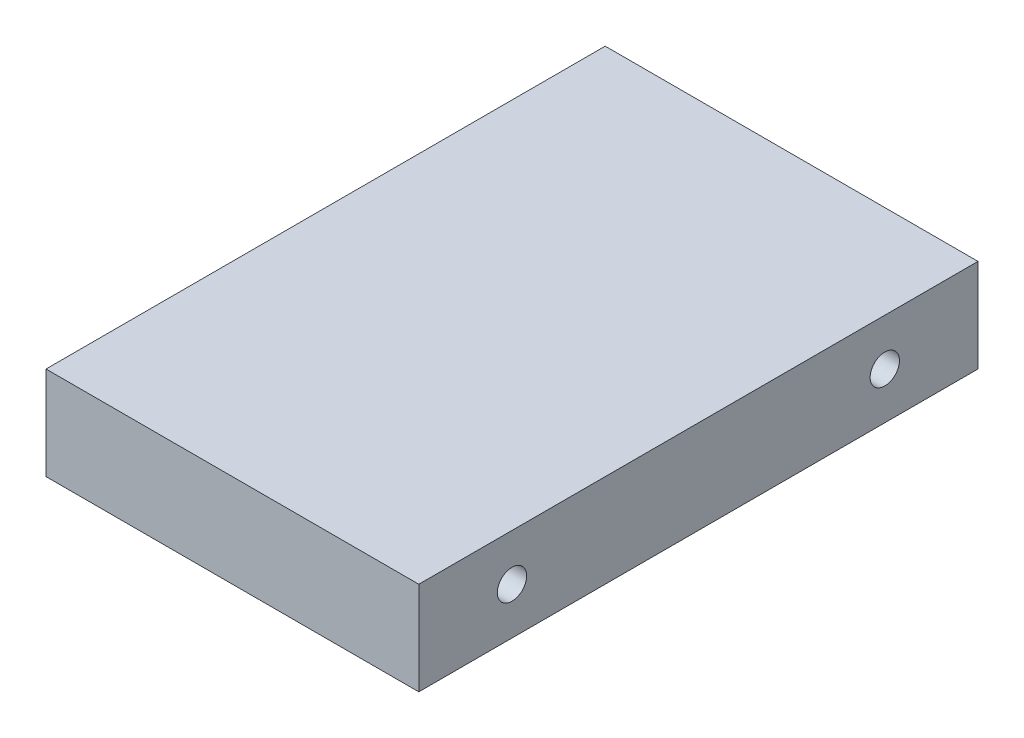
ISO-10303-21;
HEADER;
FILE_DESCRIPTION(('STEP AP214'),'2;1');
FILE_NAME('part.step','',(''),(''),'','','');
FILE_SCHEMA(('AUTOMOTIVE_DESIGN { 1 0 10303 214 1 1 1 1 }'));
ENDSEC;
DATA;
#1=APPLICATION_CONTEXT('core data for automotive mechanical design processes');
#2=APPLICATION_PROTOCOL_DEFINITION('international standard','automotive_design',2000,#1);
#3=PRODUCT_CONTEXT('',#1,'mechanical');
#4=PRODUCT('Part','Part','',(#3));
#5=PRODUCT_RELATED_PRODUCT_CATEGORY('part','',(#4));
#6=PRODUCT_DEFINITION_FORMATION('','',#4);
#7=PRODUCT_DEFINITION_CONTEXT('part definition',#1,'design');
#8=PRODUCT_DEFINITION('design','',#6,#7);
#9=PRODUCT_DEFINITION_SHAPE('','',#8);
#10=(LENGTH_UNIT() NAMED_UNIT(*) SI_UNIT(.MILLI.,.METRE.));
#11=(NAMED_UNIT(*) PLANE_ANGLE_UNIT() SI_UNIT($,.RADIAN.));
#12=(NAMED_UNIT(*) SI_UNIT($,.STERADIAN.) SOLID_ANGLE_UNIT());
#13=UNCERTAINTY_MEASURE_WITH_UNIT(LENGTH_MEASURE(1.E-05),#10,'distance_accuracy_value','');
#14=(GEOMETRIC_REPRESENTATION_CONTEXT(3) GLOBAL_UNCERTAINTY_ASSIGNED_CONTEXT((#13)) GLOBAL_UNIT_ASSIGNED_CONTEXT((#10,
#11,#12)) REPRESENTATION_CONTEXT('',''));
#15=CARTESIAN_POINT('',(0.,0.,0.));
#16=DIRECTION('',(0.,0.,1.));
#17=DIRECTION('',(1.,0.,0.));
#18=AXIS2_PLACEMENT_3D('',#15,#16,#17);
#19=CARTESIAN_POINT('',(-65.4996894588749,12.7,-16.1098780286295));
#20=DIRECTION('',(1.,0.,0.));
#21=DIRECTION('',(0.,0.,-1.));
#22=AXIS2_PLACEMENT_3D('',#19,#20,#21);
#23=PLANE('',#22);
#24=CARTESIAN_POINT('',(-65.4996894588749,6.35,-3.40987802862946));
#25=DIRECTION('',(1.,0.,0.));
#26=DIRECTION('',(0.,0.,-1.));
#27=AXIS2_PLACEMENT_3D('',#24,#25,#26);
#28=CIRCLE('',#27,1.99999999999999);
#29=CARTESIAN_POINT('',(-65.4996894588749,6.35,-5.40987802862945));
#30=VERTEX_POINT('',#29);
#31=EDGE_CURVE('E115',#30,#30,#28,.T.);
#32=ORIENTED_EDGE('',*,*,#31,.T.);
#33=EDGE_LOOP('',(#32));
#34=FACE_BOUND('',#33,.T.);
#35=CARTESIAN_POINT('',(-65.4996894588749,6.35,47.3901219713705));
#36=DIRECTION('',(1.,0.,0.));
#37=DIRECTION('',(0.,0.,-1.));
#38=AXIS2_PLACEMENT_3D('',#35,#36,#37);
#39=CIRCLE('',#38,1.99999999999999);
#40=CARTESIAN_POINT('',(-65.4996894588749,6.35,45.3901219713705));
#41=VERTEX_POINT('',#40);
#42=EDGE_CURVE('E99',#41,#41,#39,.T.);
#43=ORIENTED_EDGE('',*,*,#42,.T.);
#44=EDGE_LOOP('',(#43));
#45=FACE_BOUND('',#44,.T.);
#46=DIRECTION('',(0.,0.,1.));
#47=VECTOR('',#46,1.);
#48=CARTESIAN_POINT('',(-65.4996894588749,0.,-16.1098780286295));
#49=LINE('',#48,#47);
#50=CARTESIAN_POINT('',(-65.4996894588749,0.,-16.1098780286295));
#51=VERTEX_POINT('',#50);
#52=CARTESIAN_POINT('',(-65.4996894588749,0.,60.0901219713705));
#53=VERTEX_POINT('',#52);
#54=EDGE_CURVE('E96',#51,#53,#49,.T.);
#55=ORIENTED_EDGE('',*,*,#54,.T.);
#56=DIRECTION('',(0.,-1.,0.));
#57=VECTOR('',#56,1.);
#58=CARTESIAN_POINT('',(-65.4996894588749,12.7,60.0901219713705));
#59=LINE('',#58,#57);
#60=CARTESIAN_POINT('',(-65.4996894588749,12.7,60.0901219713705));
#61=VERTEX_POINT('',#60);
#62=EDGE_CURVE('E11',#61,#53,#59,.T.);
#63=ORIENTED_EDGE('',*,*,#62,.F.);
#64=DIRECTION('',(0.,0.,1.));
#65=VECTOR('',#64,1.);
#66=CARTESIAN_POINT('',(-65.4996894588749,12.7,-16.1098780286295));
#67=LINE('',#66,#65);
#68=CARTESIAN_POINT('',(-65.4996894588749,12.7,-16.1098780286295));
#69=VERTEX_POINT('',#68);
#70=EDGE_CURVE('E84',#69,#61,#67,.T.);
#71=ORIENTED_EDGE('',*,*,#70,.F.);
#72=DIRECTION('',(0.,-1.,0.));
#73=VECTOR('',#72,1.);
#74=CARTESIAN_POINT('',(-65.4996894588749,12.7,-16.1098780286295));
#75=LINE('',#74,#73);
#76=EDGE_CURVE('E92',#69,#51,#75,.T.);
#77=ORIENTED_EDGE('',*,*,#76,.T.);
#78=EDGE_LOOP('',(#55,#63,#71,#77));
#79=FACE_BOUND('',#78,.T.);
#80=ADVANCED_FACE('F33',(#34,#45,#79),#23,.F.);
#81=CARTESIAN_POINT('',(-65.4996894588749,12.7,60.0901219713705));
#82=DIRECTION('',(0.,0.,-1.));
#83=DIRECTION('',(-1.,0.,0.));
#84=AXIS2_PLACEMENT_3D('',#81,#82,#83);
#85=PLANE('',#84);
#86=DIRECTION('',(1.,0.,0.));
#87=VECTOR('',#86,1.);
#88=CARTESIAN_POINT('',(-65.4996894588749,0.,60.0901219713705));
#89=LINE('',#88,#87);
#90=CARTESIAN_POINT('',(-14.6996894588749,0.,60.0901219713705));
#91=VERTEX_POINT('',#90);
#92=EDGE_CURVE('E88',#53,#91,#89,.T.);
#93=ORIENTED_EDGE('',*,*,#92,.T.);
#94=DIRECTION('',(0.,-1.,0.));
#95=VECTOR('',#94,1.);
#96=CARTESIAN_POINT('',(-14.6996894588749,12.7,60.0901219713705));
#97=LINE('',#96,#95);
#98=CARTESIAN_POINT('',(-14.6996894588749,12.7,60.0901219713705));
#99=VERTEX_POINT('',#98);
#100=EDGE_CURVE('E41',#99,#91,#97,.T.);
#101=ORIENTED_EDGE('',*,*,#100,.F.);
#102=DIRECTION('',(1.,0.,0.));
#103=VECTOR('',#102,1.);
#104=CARTESIAN_POINT('',(-65.4996894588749,12.7,60.0901219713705));
#105=LINE('',#104,#103);
#106=EDGE_CURVE('E79',#61,#99,#105,.T.);
#107=ORIENTED_EDGE('',*,*,#106,.F.);
#108=ORIENTED_EDGE('',*,*,#62,.T.);
#109=EDGE_LOOP('',(#93,#101,#107,#108));
#110=FACE_BOUND('',#109,.T.);
#111=ADVANCED_FACE('F87',(#110),#85,.F.);
#112=CARTESIAN_POINT('',(-14.6996894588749,12.7,-16.1098780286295));
#113=DIRECTION('',(-1.,0.,0.));
#114=DIRECTION('',(0.,0.,1.));
#115=AXIS2_PLACEMENT_3D('',#112,#113,#114);
#116=PLANE('',#115);
#117=CARTESIAN_POINT('',(-14.6996894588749,6.35,-3.40987802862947));
#118=DIRECTION('',(1.,0.,0.));
#119=DIRECTION('',(0.,0.,-1.));
#120=AXIS2_PLACEMENT_3D('',#117,#118,#119);
#121=CIRCLE('',#120,1.99999999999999);
#122=CARTESIAN_POINT('',(-14.6996894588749,6.35,-5.40987802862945));
#123=VERTEX_POINT('',#122);
#124=EDGE_CURVE('E118',#123,#123,#121,.T.);
#125=ORIENTED_EDGE('',*,*,#124,.F.);
#126=EDGE_LOOP('',(#125));
#127=FACE_BOUND('',#126,.T.);
#128=CARTESIAN_POINT('',(-14.6996894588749,6.35,47.3901219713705));
#129=DIRECTION('',(1.,0.,0.));
#130=DIRECTION('',(0.,0.,-1.));
#131=AXIS2_PLACEMENT_3D('',#128,#129,#130);
#132=CIRCLE('',#131,1.99999999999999);
#133=CARTESIAN_POINT('',(-14.6996894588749,6.35,45.3901219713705));
#134=VERTEX_POINT('',#133);
#135=EDGE_CURVE('E112',#134,#134,#132,.T.);
#136=ORIENTED_EDGE('',*,*,#135,.F.);
#137=EDGE_LOOP('',(#136));
#138=FACE_BOUND('',#137,.T.);
#139=DIRECTION('',(0.,0.,-1.));
#140=VECTOR('',#139,1.);
#141=CARTESIAN_POINT('',(-14.6996894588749,0.,-16.1098780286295));
#142=LINE('',#141,#140);
#143=CARTESIAN_POINT('',(-14.6996894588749,0.,-16.1098780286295));
#144=VERTEX_POINT('',#143);
#145=EDGE_CURVE('E66',#91,#144,#142,.T.);
#146=ORIENTED_EDGE('',*,*,#145,.T.);
#147=DIRECTION('',(0.,-1.,0.));
#148=VECTOR('',#147,1.);
#149=CARTESIAN_POINT('',(-14.6996894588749,12.7,-16.1098780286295));
#150=LINE('',#149,#148);
#151=CARTESIAN_POINT('',(-14.6996894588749,12.7,-16.1098780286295));
#152=VERTEX_POINT('',#151);
#153=EDGE_CURVE('E89',#152,#144,#150,.T.);
#154=ORIENTED_EDGE('',*,*,#153,.F.);
#155=DIRECTION('',(0.,0.,-1.));
#156=VECTOR('',#155,1.);
#157=CARTESIAN_POINT('',(-14.6996894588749,12.7,-16.1098780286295));
#158=LINE('',#157,#156);
#159=EDGE_CURVE('E82',#99,#152,#158,.T.);
#160=ORIENTED_EDGE('',*,*,#159,.F.);
#161=ORIENTED_EDGE('',*,*,#100,.T.);
#162=EDGE_LOOP('',(#146,#154,#160,#161));
#163=FACE_BOUND('',#162,.T.);
#164=ADVANCED_FACE('F90',(#127,#138,#163),#116,.F.);
#165=CARTESIAN_POINT('',(-65.4996894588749,12.7,-16.1098780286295));
#166=DIRECTION('',(0.,0.,1.));
#167=DIRECTION('',(1.,0.,0.));
#168=AXIS2_PLACEMENT_3D('',#165,#166,#167);
#169=PLANE('',#168);
#170=DIRECTION('',(-1.,0.,0.));
#171=VECTOR('',#170,1.);
#172=CARTESIAN_POINT('',(-65.4996894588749,0.,-16.1098780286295));
#173=LINE('',#172,#171);
#174=EDGE_CURVE('E72',#144,#51,#173,.T.);
#175=ORIENTED_EDGE('',*,*,#174,.T.);
#176=ORIENTED_EDGE('',*,*,#76,.F.);
#177=DIRECTION('',(-1.,0.,0.));
#178=VECTOR('',#177,1.);
#179=CARTESIAN_POINT('',(-65.4996894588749,12.7,-16.1098780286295));
#180=LINE('',#179,#178);
#181=EDGE_CURVE('E49',#152,#69,#180,.T.);
#182=ORIENTED_EDGE('',*,*,#181,.F.);
#183=ORIENTED_EDGE('',*,*,#153,.T.);
#184=EDGE_LOOP('',(#175,#176,#182,#183));
#185=FACE_BOUND('',#184,.T.);
#186=ADVANCED_FACE('F104',(#185),#169,.F.);
#187=CARTESIAN_POINT('',(-65.4996894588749,12.7,60.0901219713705));
#188=DIRECTION('',(0.,1.,0.));
#189=DIRECTION('',(0.,0.,1.));
#190=AXIS2_PLACEMENT_3D('',#187,#188,#189);
#191=PLANE('',#190);
#192=ORIENTED_EDGE('',*,*,#70,.T.);
#193=ORIENTED_EDGE('',*,*,#106,.T.);
#194=ORIENTED_EDGE('',*,*,#159,.T.);
#195=ORIENTED_EDGE('',*,*,#181,.T.);
#196=EDGE_LOOP('',(#192,#193,#194,#195));
#197=FACE_BOUND('',#196,.T.);
#198=ADVANCED_FACE('F80',(#197),#191,.T.);
#199=CARTESIAN_POINT('',(-65.4996894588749,0.,60.0901219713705));
#200=DIRECTION('',(0.,1.,0.));
#201=DIRECTION('',(0.,0.,1.));
#202=AXIS2_PLACEMENT_3D('',#199,#200,#201);
#203=PLANE('',#202);
#204=ORIENTED_EDGE('',*,*,#54,.F.);
#205=ORIENTED_EDGE('',*,*,#174,.F.);
#206=ORIENTED_EDGE('',*,*,#145,.F.);
#207=ORIENTED_EDGE('',*,*,#92,.F.);
#208=EDGE_LOOP('',(#204,#205,#206,#207));
#209=FACE_BOUND('',#208,.T.);
#210=ADVANCED_FACE('F107',(#209),#203,.F.);
#211=CARTESIAN_POINT('',(-14.6996894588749,6.35,47.3901219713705));
#212=DIRECTION('',(1.,0.,0.));
#213=DIRECTION('',(0.,0.,-1.));
#214=AXIS2_PLACEMENT_3D('',#211,#212,#213);
#215=CYLINDRICAL_SURFACE('',#214,1.99999999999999);
#216=ORIENTED_EDGE('',*,*,#42,.F.);
#217=EDGE_LOOP('',(#216));
#218=FACE_BOUND('',#217,.T.);
#219=ORIENTED_EDGE('',*,*,#135,.T.);
#220=EDGE_LOOP('',(#219));
#221=FACE_BOUND('',#220,.T.);
#222=ADVANCED_FACE('F129',(#218,#221),#215,.F.);
#223=CARTESIAN_POINT('',(-14.6996894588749,6.35,-3.40987802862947));
#224=DIRECTION('',(1.,0.,0.));
#225=DIRECTION('',(0.,0.,-1.));
#226=AXIS2_PLACEMENT_3D('',#223,#224,#225);
#227=CYLINDRICAL_SURFACE('',#226,1.99999999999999);
#228=ORIENTED_EDGE('',*,*,#31,.F.);
#229=EDGE_LOOP('',(#228));
#230=FACE_BOUND('',#229,.T.);
#231=ORIENTED_EDGE('',*,*,#124,.T.);
#232=EDGE_LOOP('',(#231));
#233=FACE_BOUND('',#232,.T.);
#234=ADVANCED_FACE('F122',(#230,#233),#227,.F.);
#235=CLOSED_SHELL('',(#80,#111,#164,#186,#198,#210,#222,#234));
#236=MANIFOLD_SOLID_BREP('B2',#235);
#237=ADVANCED_BREP_SHAPE_REPRESENTATION('',(#18,#236),#14);
#238=SHAPE_DEFINITION_REPRESENTATION(#9,#237);
ENDSEC;
END-ISO-10303-21;
